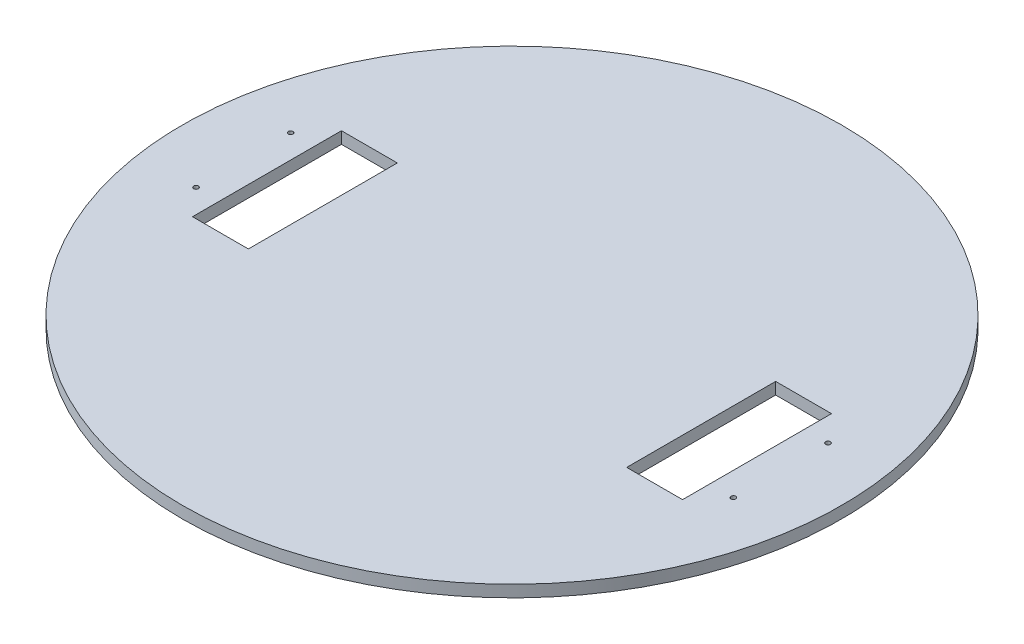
ISO-10303-21;
HEADER;
FILE_DESCRIPTION(('STEP AP214'),'2;1');
FILE_NAME('part.step','',(''),(''),'','','');
FILE_SCHEMA(('AUTOMOTIVE_DESIGN { 1 0 10303 214 1 1 1 1 }'));
ENDSEC;
DATA;
#1=APPLICATION_CONTEXT('core data for automotive mechanical design processes');
#2=APPLICATION_PROTOCOL_DEFINITION('international standard','automotive_design',2000,#1);
#3=PRODUCT_CONTEXT('',#1,'mechanical');
#4=PRODUCT('Part','Part','',(#3));
#5=PRODUCT_RELATED_PRODUCT_CATEGORY('part','',(#4));
#6=PRODUCT_DEFINITION_FORMATION('','',#4);
#7=PRODUCT_DEFINITION_CONTEXT('part definition',#1,'design');
#8=PRODUCT_DEFINITION('design','',#6,#7);
#9=PRODUCT_DEFINITION_SHAPE('','',#8);
#10=(LENGTH_UNIT() NAMED_UNIT(*) SI_UNIT(.MILLI.,.METRE.));
#11=(NAMED_UNIT(*) PLANE_ANGLE_UNIT() SI_UNIT($,.RADIAN.));
#12=(NAMED_UNIT(*) SI_UNIT($,.STERADIAN.) SOLID_ANGLE_UNIT());
#13=UNCERTAINTY_MEASURE_WITH_UNIT(LENGTH_MEASURE(1.E-05),#10,'distance_accuracy_value','');
#14=(GEOMETRIC_REPRESENTATION_CONTEXT(3) GLOBAL_UNCERTAINTY_ASSIGNED_CONTEXT((#13)) GLOBAL_UNIT_ASSIGNED_CONTEXT((#10,
#11,#12)) REPRESENTATION_CONTEXT('',''));
#15=CARTESIAN_POINT('',(0.,0.,0.));
#16=DIRECTION('',(0.,0.,1.));
#17=DIRECTION('',(1.,0.,0.));
#18=AXIS2_PLACEMENT_3D('',#15,#16,#17);
#19=CARTESIAN_POINT('',(0.,6.35,0.));
#20=DIRECTION('',(0.,1.,0.));
#21=DIRECTION('',(0.,0.,1.));
#22=AXIS2_PLACEMENT_3D('',#19,#20,#21);
#23=PLANE('',#22);
#24=CARTESIAN_POINT('',(144.3,6.35,-25.4));
#25=DIRECTION('',(0.,1.,0.));
#26=DIRECTION('',(0.,0.,1.));
#27=AXIS2_PLACEMENT_3D('',#24,#25,#26);
#28=CIRCLE('',#27,1.27);
#29=CARTESIAN_POINT('',(144.3,6.35,-24.13));
#30=VERTEX_POINT('',#29);
#31=EDGE_CURVE('E202',#30,#30,#28,.T.);
#32=ORIENTED_EDGE('',*,*,#31,.F.);
#33=EDGE_LOOP('',(#32));
#34=FACE_BOUND('',#33,.T.);
#35=CARTESIAN_POINT('',(-144.3,6.35,-25.4));
#36=DIRECTION('',(0.,1.,0.));
#37=DIRECTION('',(0.,0.,1.));
#38=AXIS2_PLACEMENT_3D('',#35,#36,#37);
#39=CIRCLE('',#38,1.27);
#40=CARTESIAN_POINT('',(-144.3,6.35,-24.13));
#41=VERTEX_POINT('',#40);
#42=EDGE_CURVE('E131',#41,#41,#39,.T.);
#43=ORIENTED_EDGE('',*,*,#42,.F.);
#44=EDGE_LOOP('',(#43));
#45=FACE_BOUND('',#44,.T.);
#46=CARTESIAN_POINT('',(0.,6.35,0.));
#47=DIRECTION('',(0.,1.,0.));
#48=DIRECTION('',(0.,0.,1.));
#49=AXIS2_PLACEMENT_3D('',#46,#47,#48);
#50=CIRCLE('',#49,177.);
#51=CARTESIAN_POINT('',(0.,6.35,177.));
#52=VERTEX_POINT('',#51);
#53=EDGE_CURVE('E11',#52,#52,#50,.T.);
#54=ORIENTED_EDGE('',*,*,#53,.T.);
#55=EDGE_LOOP('',(#54));
#56=FACE_BOUND('',#55,.T.);
#57=DIRECTION('',(1.,0.,0.));
#58=VECTOR('',#57,1.);
#59=CARTESIAN_POINT('',(-131.6,6.35,40.));
#60=LINE('',#59,#58);
#61=CARTESIAN_POINT('',(-131.6,6.35,40.));
#62=VERTEX_POINT('',#61);
#63=CARTESIAN_POINT('',(-101.6,6.35,40.));
#64=VERTEX_POINT('',#63);
#65=EDGE_CURVE('E143',#62,#64,#60,.T.);
#66=ORIENTED_EDGE('',*,*,#65,.F.);
#67=DIRECTION('',(0.,0.,1.));
#68=VECTOR('',#67,1.);
#69=CARTESIAN_POINT('',(-131.6,6.35,-40.));
#70=LINE('',#69,#68);
#71=CARTESIAN_POINT('',(-131.6,6.35,-40.));
#72=VERTEX_POINT('',#71);
#73=EDGE_CURVE('E141',#72,#62,#70,.T.);
#74=ORIENTED_EDGE('',*,*,#73,.F.);
#75=DIRECTION('',(-1.,0.,0.));
#76=VECTOR('',#75,1.);
#77=CARTESIAN_POINT('',(-131.6,6.35,-40.));
#78=LINE('',#77,#76);
#79=CARTESIAN_POINT('',(-101.6,6.35,-40.));
#80=VERTEX_POINT('',#79);
#81=EDGE_CURVE('E149',#80,#72,#78,.T.);
#82=ORIENTED_EDGE('',*,*,#81,.F.);
#83=DIRECTION('',(0.,0.,-1.));
#84=VECTOR('',#83,1.);
#85=CARTESIAN_POINT('',(-101.6,6.35,-40.));
#86=LINE('',#85,#84);
#87=EDGE_CURVE('E146',#64,#80,#86,.T.);
#88=ORIENTED_EDGE('',*,*,#87,.F.);
#89=EDGE_LOOP('',(#66,#74,#82,#88));
#90=FACE_BOUND('',#89,.T.);
#91=DIRECTION('',(1.,0.,0.));
#92=VECTOR('',#91,1.);
#93=CARTESIAN_POINT('',(101.6,6.35,40.));
#94=LINE('',#93,#92);
#95=CARTESIAN_POINT('',(101.6,6.35,40.));
#96=VERTEX_POINT('',#95);
#97=CARTESIAN_POINT('',(131.6,6.35,40.));
#98=VERTEX_POINT('',#97);
#99=EDGE_CURVE('E110',#96,#98,#94,.T.);
#100=ORIENTED_EDGE('',*,*,#99,.F.);
#101=DIRECTION('',(0.,0.,1.));
#102=VECTOR('',#101,1.);
#103=CARTESIAN_POINT('',(101.6,6.35,-40.));
#104=LINE('',#103,#102);
#105=CARTESIAN_POINT('',(101.6,6.35,-40.));
#106=VERTEX_POINT('',#105);
#107=EDGE_CURVE('E102',#106,#96,#104,.T.);
#108=ORIENTED_EDGE('',*,*,#107,.F.);
#109=DIRECTION('',(-1.,0.,0.));
#110=VECTOR('',#109,1.);
#111=CARTESIAN_POINT('',(101.6,6.35,-40.));
#112=LINE('',#111,#110);
#113=CARTESIAN_POINT('',(131.6,6.35,-40.));
#114=VERTEX_POINT('',#113);
#115=EDGE_CURVE('E125',#114,#106,#112,.T.);
#116=ORIENTED_EDGE('',*,*,#115,.F.);
#117=DIRECTION('',(0.,0.,-1.));
#118=VECTOR('',#117,1.);
#119=CARTESIAN_POINT('',(131.6,6.35,-40.));
#120=LINE('',#119,#118);
#121=EDGE_CURVE('E123',#98,#114,#120,.T.);
#122=ORIENTED_EDGE('',*,*,#121,.F.);
#123=EDGE_LOOP('',(#100,#108,#116,#122));
#124=FACE_BOUND('',#123,.T.);
#125=CARTESIAN_POINT('',(-144.3,6.35,25.4));
#126=DIRECTION('',(0.,1.,0.));
#127=DIRECTION('',(0.,0.,1.));
#128=AXIS2_PLACEMENT_3D('',#125,#126,#127);
#129=CIRCLE('',#128,1.27);
#130=CARTESIAN_POINT('',(-144.3,6.35,26.67));
#131=VERTEX_POINT('',#130);
#132=EDGE_CURVE('E206',#131,#131,#129,.T.);
#133=ORIENTED_EDGE('',*,*,#132,.F.);
#134=EDGE_LOOP('',(#133));
#135=FACE_BOUND('',#134,.T.);
#136=CARTESIAN_POINT('',(144.3,6.35,25.4));
#137=DIRECTION('',(0.,1.,0.));
#138=DIRECTION('',(0.,0.,1.));
#139=AXIS2_PLACEMENT_3D('',#136,#137,#138);
#140=CIRCLE('',#139,1.27);
#141=CARTESIAN_POINT('',(144.3,6.35,26.67));
#142=VERTEX_POINT('',#141);
#143=EDGE_CURVE('E197',#142,#142,#140,.T.);
#144=ORIENTED_EDGE('',*,*,#143,.F.);
#145=EDGE_LOOP('',(#144));
#146=FACE_BOUND('',#145,.T.);
#147=ADVANCED_FACE('F37',(#34,#45,#56,#90,#124,#135,#146),#23,.T.);
#148=CARTESIAN_POINT('',(0.,0.,0.));
#149=DIRECTION('',(0.,1.,0.));
#150=DIRECTION('',(0.,0.,1.));
#151=AXIS2_PLACEMENT_3D('',#148,#149,#150);
#152=PLANE('',#151);
#153=DIRECTION('',(0.,0.,1.));
#154=VECTOR('',#153,1.);
#155=CARTESIAN_POINT('',(-131.6,0.,-40.));
#156=LINE('',#155,#154);
#157=CARTESIAN_POINT('',(-131.6,0.,-40.));
#158=VERTEX_POINT('',#157);
#159=CARTESIAN_POINT('',(-131.6,0.,40.));
#160=VERTEX_POINT('',#159);
#161=EDGE_CURVE('E118',#158,#160,#156,.T.);
#162=ORIENTED_EDGE('',*,*,#161,.T.);
#163=DIRECTION('',(1.,0.,0.));
#164=VECTOR('',#163,1.);
#165=CARTESIAN_POINT('',(-131.6,0.,40.));
#166=LINE('',#165,#164);
#167=CARTESIAN_POINT('',(-101.6,0.,40.));
#168=VERTEX_POINT('',#167);
#169=EDGE_CURVE('E154',#160,#168,#166,.T.);
#170=ORIENTED_EDGE('',*,*,#169,.T.);
#171=DIRECTION('',(0.,0.,-1.));
#172=VECTOR('',#171,1.);
#173=CARTESIAN_POINT('',(-101.6,0.,-40.));
#174=LINE('',#173,#172);
#175=CARTESIAN_POINT('',(-101.6,0.,-40.));
#176=VERTEX_POINT('',#175);
#177=EDGE_CURVE('E157',#168,#176,#174,.T.);
#178=ORIENTED_EDGE('',*,*,#177,.T.);
#179=DIRECTION('',(-1.,0.,0.));
#180=VECTOR('',#179,1.);
#181=CARTESIAN_POINT('',(-131.6,0.,-40.));
#182=LINE('',#181,#180);
#183=EDGE_CURVE('E144',#176,#158,#182,.T.);
#184=ORIENTED_EDGE('',*,*,#183,.T.);
#185=EDGE_LOOP('',(#162,#170,#178,#184));
#186=FACE_BOUND('',#185,.T.);
#187=CARTESIAN_POINT('',(0.,0.,0.));
#188=DIRECTION('',(0.,1.,0.));
#189=DIRECTION('',(0.,0.,1.));
#190=AXIS2_PLACEMENT_3D('',#187,#188,#189);
#191=CIRCLE('',#190,177.);
#192=CARTESIAN_POINT('',(0.,0.,177.));
#193=VERTEX_POINT('',#192);
#194=EDGE_CURVE('E41',#193,#193,#191,.T.);
#195=ORIENTED_EDGE('',*,*,#194,.F.);
#196=EDGE_LOOP('',(#195));
#197=FACE_BOUND('',#196,.T.);
#198=DIRECTION('',(0.,0.,1.));
#199=VECTOR('',#198,1.);
#200=CARTESIAN_POINT('',(101.6,0.,-40.));
#201=LINE('',#200,#199);
#202=CARTESIAN_POINT('',(101.6,0.,-40.));
#203=VERTEX_POINT('',#202);
#204=CARTESIAN_POINT('',(101.6,0.,40.));
#205=VERTEX_POINT('',#204);
#206=EDGE_CURVE('E60',#203,#205,#201,.T.);
#207=ORIENTED_EDGE('',*,*,#206,.T.);
#208=DIRECTION('',(1.,0.,0.));
#209=VECTOR('',#208,1.);
#210=CARTESIAN_POINT('',(101.6,0.,40.));
#211=LINE('',#210,#209);
#212=CARTESIAN_POINT('',(131.6,0.,40.));
#213=VERTEX_POINT('',#212);
#214=EDGE_CURVE('E117',#205,#213,#211,.T.);
#215=ORIENTED_EDGE('',*,*,#214,.T.);
#216=DIRECTION('',(0.,0.,-1.));
#217=VECTOR('',#216,1.);
#218=CARTESIAN_POINT('',(131.6,0.,-40.));
#219=LINE('',#218,#217);
#220=CARTESIAN_POINT('',(131.6,0.,-40.));
#221=VERTEX_POINT('',#220);
#222=EDGE_CURVE('E133',#213,#221,#219,.T.);
#223=ORIENTED_EDGE('',*,*,#222,.T.);
#224=DIRECTION('',(-1.,0.,0.));
#225=VECTOR('',#224,1.);
#226=CARTESIAN_POINT('',(101.6,0.,-40.));
#227=LINE('',#226,#225);
#228=EDGE_CURVE('E111',#221,#203,#227,.T.);
#229=ORIENTED_EDGE('',*,*,#228,.T.);
#230=EDGE_LOOP('',(#207,#215,#223,#229));
#231=FACE_BOUND('',#230,.T.);
#232=CARTESIAN_POINT('',(-144.3,0.,-25.4));
#233=DIRECTION('',(0.,1.,0.));
#234=DIRECTION('',(0.,0.,1.));
#235=AXIS2_PLACEMENT_3D('',#232,#233,#234);
#236=CIRCLE('',#235,1.27);
#237=CARTESIAN_POINT('',(-144.3,0.,-24.13));
#238=VERTEX_POINT('',#237);
#239=EDGE_CURVE('E184',#238,#238,#236,.T.);
#240=ORIENTED_EDGE('',*,*,#239,.T.);
#241=EDGE_LOOP('',(#240));
#242=FACE_BOUND('',#241,.T.);
#243=CARTESIAN_POINT('',(-144.3,0.,25.4));
#244=DIRECTION('',(0.,1.,0.));
#245=DIRECTION('',(0.,0.,1.));
#246=AXIS2_PLACEMENT_3D('',#243,#244,#245);
#247=CIRCLE('',#246,1.27);
#248=CARTESIAN_POINT('',(-144.3,0.,26.67));
#249=VERTEX_POINT('',#248);
#250=EDGE_CURVE('E188',#249,#249,#247,.T.);
#251=ORIENTED_EDGE('',*,*,#250,.T.);
#252=EDGE_LOOP('',(#251));
#253=FACE_BOUND('',#252,.T.);
#254=CARTESIAN_POINT('',(144.3,0.,-25.4));
#255=DIRECTION('',(0.,1.,0.));
#256=DIRECTION('',(0.,0.,1.));
#257=AXIS2_PLACEMENT_3D('',#254,#255,#256);
#258=CIRCLE('',#257,1.27);
#259=CARTESIAN_POINT('',(144.3,0.,-24.13));
#260=VERTEX_POINT('',#259);
#261=EDGE_CURVE('E192',#260,#260,#258,.T.);
#262=ORIENTED_EDGE('',*,*,#261,.T.);
#263=EDGE_LOOP('',(#262));
#264=FACE_BOUND('',#263,.T.);
#265=CARTESIAN_POINT('',(144.3,0.,25.4));
#266=DIRECTION('',(0.,1.,0.));
#267=DIRECTION('',(0.,0.,1.));
#268=AXIS2_PLACEMENT_3D('',#265,#266,#267);
#269=CIRCLE('',#268,1.27);
#270=CARTESIAN_POINT('',(144.3,0.,26.67));
#271=VERTEX_POINT('',#270);
#272=EDGE_CURVE('E195',#271,#271,#269,.T.);
#273=ORIENTED_EDGE('',*,*,#272,.T.);
#274=EDGE_LOOP('',(#273));
#275=FACE_BOUND('',#274,.T.);
#276=ADVANCED_FACE('F176',(#186,#197,#231,#242,#253,#264,#275),#152,.F.);
#277=CARTESIAN_POINT('',(0.,6.35,0.));
#278=DIRECTION('',(0.,-1.,0.));
#279=DIRECTION('',(0.,0.,-1.));
#280=AXIS2_PLACEMENT_3D('',#277,#278,#279);
#281=CYLINDRICAL_SURFACE('',#280,177.);
#282=ORIENTED_EDGE('',*,*,#53,.F.);
#283=EDGE_LOOP('',(#282));
#284=FACE_BOUND('',#283,.T.);
#285=ORIENTED_EDGE('',*,*,#194,.T.);
#286=EDGE_LOOP('',(#285));
#287=FACE_BOUND('',#286,.T.);
#288=ADVANCED_FACE('F39',(#284,#287),#281,.T.);
#289=CARTESIAN_POINT('',(-131.6,6.35,-40.));
#290=DIRECTION('',(1.,0.,0.));
#291=DIRECTION('',(0.,0.,-1.));
#292=AXIS2_PLACEMENT_3D('',#289,#290,#291);
#293=PLANE('',#292);
#294=ORIENTED_EDGE('',*,*,#161,.F.);
#295=DIRECTION('',(0.,-1.,0.));
#296=VECTOR('',#295,1.);
#297=CARTESIAN_POINT('',(-131.6,6.35,-40.));
#298=LINE('',#297,#296);
#299=EDGE_CURVE('E151',#72,#158,#298,.T.);
#300=ORIENTED_EDGE('',*,*,#299,.F.);
#301=ORIENTED_EDGE('',*,*,#73,.T.);
#302=DIRECTION('',(0.,-1.,0.));
#303=VECTOR('',#302,1.);
#304=CARTESIAN_POINT('',(-131.6,6.35,40.));
#305=LINE('',#304,#303);
#306=EDGE_CURVE('E168',#62,#160,#305,.T.);
#307=ORIENTED_EDGE('',*,*,#306,.T.);
#308=EDGE_LOOP('',(#294,#300,#301,#307));
#309=FACE_BOUND('',#308,.T.);
#310=ADVANCED_FACE('F234',(#309),#293,.T.);
#311=CARTESIAN_POINT('',(-131.6,6.35,40.));
#312=DIRECTION('',(0.,0.,-1.));
#313=DIRECTION('',(-1.,0.,0.));
#314=AXIS2_PLACEMENT_3D('',#311,#312,#313);
#315=PLANE('',#314);
#316=ORIENTED_EDGE('',*,*,#169,.F.);
#317=ORIENTED_EDGE('',*,*,#306,.F.);
#318=ORIENTED_EDGE('',*,*,#65,.T.);
#319=DIRECTION('',(0.,-1.,0.));
#320=VECTOR('',#319,1.);
#321=CARTESIAN_POINT('',(-101.6,6.35,40.));
#322=LINE('',#321,#320);
#323=EDGE_CURVE('E166',#64,#168,#322,.T.);
#324=ORIENTED_EDGE('',*,*,#323,.T.);
#325=EDGE_LOOP('',(#316,#317,#318,#324));
#326=FACE_BOUND('',#325,.T.);
#327=ADVANCED_FACE('F228',(#326),#315,.T.);
#328=CARTESIAN_POINT('',(-101.6,6.35,-40.));
#329=DIRECTION('',(-1.,0.,0.));
#330=DIRECTION('',(0.,0.,1.));
#331=AXIS2_PLACEMENT_3D('',#328,#329,#330);
#332=PLANE('',#331);
#333=ORIENTED_EDGE('',*,*,#177,.F.);
#334=ORIENTED_EDGE('',*,*,#323,.F.);
#335=ORIENTED_EDGE('',*,*,#87,.T.);
#336=DIRECTION('',(0.,-1.,0.));
#337=VECTOR('',#336,1.);
#338=CARTESIAN_POINT('',(-101.6,6.35,-40.));
#339=LINE('',#338,#337);
#340=EDGE_CURVE('E164',#80,#176,#339,.T.);
#341=ORIENTED_EDGE('',*,*,#340,.T.);
#342=EDGE_LOOP('',(#333,#334,#335,#341));
#343=FACE_BOUND('',#342,.T.);
#344=ADVANCED_FACE('F231',(#343),#332,.T.);
#345=CARTESIAN_POINT('',(-131.6,6.35,-40.));
#346=DIRECTION('',(0.,0.,1.));
#347=DIRECTION('',(1.,0.,0.));
#348=AXIS2_PLACEMENT_3D('',#345,#346,#347);
#349=PLANE('',#348);
#350=ORIENTED_EDGE('',*,*,#183,.F.);
#351=ORIENTED_EDGE('',*,*,#340,.F.);
#352=ORIENTED_EDGE('',*,*,#81,.T.);
#353=ORIENTED_EDGE('',*,*,#299,.T.);
#354=EDGE_LOOP('',(#350,#351,#352,#353));
#355=FACE_BOUND('',#354,.T.);
#356=ADVANCED_FACE('F236',(#355),#349,.T.);
#357=CARTESIAN_POINT('',(101.6,6.35,-40.));
#358=DIRECTION('',(1.,0.,0.));
#359=DIRECTION('',(0.,0.,-1.));
#360=AXIS2_PLACEMENT_3D('',#357,#358,#359);
#361=PLANE('',#360);
#362=ORIENTED_EDGE('',*,*,#206,.F.);
#363=DIRECTION('',(0.,-1.,0.));
#364=VECTOR('',#363,1.);
#365=CARTESIAN_POINT('',(101.6,6.35,-40.));
#366=LINE('',#365,#364);
#367=EDGE_CURVE('E106',#106,#203,#366,.T.);
#368=ORIENTED_EDGE('',*,*,#367,.F.);
#369=ORIENTED_EDGE('',*,*,#107,.T.);
#370=DIRECTION('',(0.,-1.,0.));
#371=VECTOR('',#370,1.);
#372=CARTESIAN_POINT('',(101.6,6.35,40.));
#373=LINE('',#372,#371);
#374=EDGE_CURVE('E105',#96,#205,#373,.T.);
#375=ORIENTED_EDGE('',*,*,#374,.T.);
#376=EDGE_LOOP('',(#362,#368,#369,#375));
#377=FACE_BOUND('',#376,.T.);
#378=ADVANCED_FACE('F104',(#377),#361,.T.);
#379=CARTESIAN_POINT('',(101.6,6.35,40.));
#380=DIRECTION('',(0.,0.,-1.));
#381=DIRECTION('',(-1.,0.,0.));
#382=AXIS2_PLACEMENT_3D('',#379,#380,#381);
#383=PLANE('',#382);
#384=ORIENTED_EDGE('',*,*,#214,.F.);
#385=ORIENTED_EDGE('',*,*,#374,.F.);
#386=ORIENTED_EDGE('',*,*,#99,.T.);
#387=DIRECTION('',(0.,-1.,0.));
#388=VECTOR('',#387,1.);
#389=CARTESIAN_POINT('',(131.6,6.35,40.));
#390=LINE('',#389,#388);
#391=EDGE_CURVE('E119',#98,#213,#390,.T.);
#392=ORIENTED_EDGE('',*,*,#391,.T.);
#393=EDGE_LOOP('',(#384,#385,#386,#392));
#394=FACE_BOUND('',#393,.T.);
#395=ADVANCED_FACE('F114',(#394),#383,.T.);
#396=CARTESIAN_POINT('',(131.6,6.35,-40.));
#397=DIRECTION('',(-1.,0.,0.));
#398=DIRECTION('',(0.,0.,1.));
#399=AXIS2_PLACEMENT_3D('',#396,#397,#398);
#400=PLANE('',#399);
#401=ORIENTED_EDGE('',*,*,#222,.F.);
#402=ORIENTED_EDGE('',*,*,#391,.F.);
#403=ORIENTED_EDGE('',*,*,#121,.T.);
#404=DIRECTION('',(0.,-1.,0.));
#405=VECTOR('',#404,1.);
#406=CARTESIAN_POINT('',(131.6,6.35,-40.));
#407=LINE('',#406,#405);
#408=EDGE_CURVE('E52',#114,#221,#407,.T.);
#409=ORIENTED_EDGE('',*,*,#408,.T.);
#410=EDGE_LOOP('',(#401,#402,#403,#409));
#411=FACE_BOUND('',#410,.T.);
#412=ADVANCED_FACE('F318',(#411),#400,.T.);
#413=CARTESIAN_POINT('',(101.6,6.35,-40.));
#414=DIRECTION('',(0.,0.,1.));
#415=DIRECTION('',(1.,0.,0.));
#416=AXIS2_PLACEMENT_3D('',#413,#414,#415);
#417=PLANE('',#416);
#418=ORIENTED_EDGE('',*,*,#228,.F.);
#419=ORIENTED_EDGE('',*,*,#408,.F.);
#420=ORIENTED_EDGE('',*,*,#115,.T.);
#421=ORIENTED_EDGE('',*,*,#367,.T.);
#422=EDGE_LOOP('',(#418,#419,#420,#421));
#423=FACE_BOUND('',#422,.T.);
#424=ADVANCED_FACE('F327',(#423),#417,.T.);
#425=CARTESIAN_POINT('',(-144.3,6.35,-25.4));
#426=DIRECTION('',(0.,-1.,0.));
#427=DIRECTION('',(0.,0.,-1.));
#428=AXIS2_PLACEMENT_3D('',#425,#426,#427);
#429=CYLINDRICAL_SURFACE('',#428,1.27);
#430=ORIENTED_EDGE('',*,*,#42,.T.);
#431=EDGE_LOOP('',(#430));
#432=FACE_BOUND('',#431,.T.);
#433=ORIENTED_EDGE('',*,*,#239,.F.);
#434=EDGE_LOOP('',(#433));
#435=FACE_BOUND('',#434,.T.);
#436=ADVANCED_FACE('F213',(#432,#435),#429,.F.);
#437=CARTESIAN_POINT('',(-144.3,6.35,25.4));
#438=DIRECTION('',(0.,-1.,0.));
#439=DIRECTION('',(0.,0.,-1.));
#440=AXIS2_PLACEMENT_3D('',#437,#438,#439);
#441=CYLINDRICAL_SURFACE('',#440,1.27);
#442=ORIENTED_EDGE('',*,*,#132,.T.);
#443=EDGE_LOOP('',(#442));
#444=FACE_BOUND('',#443,.T.);
#445=ORIENTED_EDGE('',*,*,#250,.F.);
#446=EDGE_LOOP('',(#445));
#447=FACE_BOUND('',#446,.T.);
#448=ADVANCED_FACE('F347',(#444,#447),#441,.F.);
#449=CARTESIAN_POINT('',(144.3,6.35,-25.4));
#450=DIRECTION('',(0.,-1.,0.));
#451=DIRECTION('',(0.,0.,-1.));
#452=AXIS2_PLACEMENT_3D('',#449,#450,#451);
#453=CYLINDRICAL_SURFACE('',#452,1.27);
#454=ORIENTED_EDGE('',*,*,#31,.T.);
#455=EDGE_LOOP('',(#454));
#456=FACE_BOUND('',#455,.T.);
#457=ORIENTED_EDGE('',*,*,#261,.F.);
#458=EDGE_LOOP('',(#457));
#459=FACE_BOUND('',#458,.T.);
#460=ADVANCED_FACE('F357',(#456,#459),#453,.F.);
#461=CARTESIAN_POINT('',(144.3,6.35,25.4));
#462=DIRECTION('',(0.,-1.,0.));
#463=DIRECTION('',(0.,0.,-1.));
#464=AXIS2_PLACEMENT_3D('',#461,#462,#463);
#465=CYLINDRICAL_SURFACE('',#464,1.27);
#466=ORIENTED_EDGE('',*,*,#143,.T.);
#467=EDGE_LOOP('',(#466));
#468=FACE_BOUND('',#467,.T.);
#469=ORIENTED_EDGE('',*,*,#272,.F.);
#470=EDGE_LOOP('',(#469));
#471=FACE_BOUND('',#470,.T.);
#472=ADVANCED_FACE('F368',(#468,#471),#465,.F.);
#473=CLOSED_SHELL('',(#147,#276,#288,#310,#327,#344,#356,#378,#395,#412,#424,#436,#448,#460,#472));
#474=MANIFOLD_SOLID_BREP('B2',#473);
#475=ADVANCED_BREP_SHAPE_REPRESENTATION('',(#18,#474),#14);
#476=SHAPE_DEFINITION_REPRESENTATION(#9,#475);
ENDSEC;
END-ISO-10303-21;
